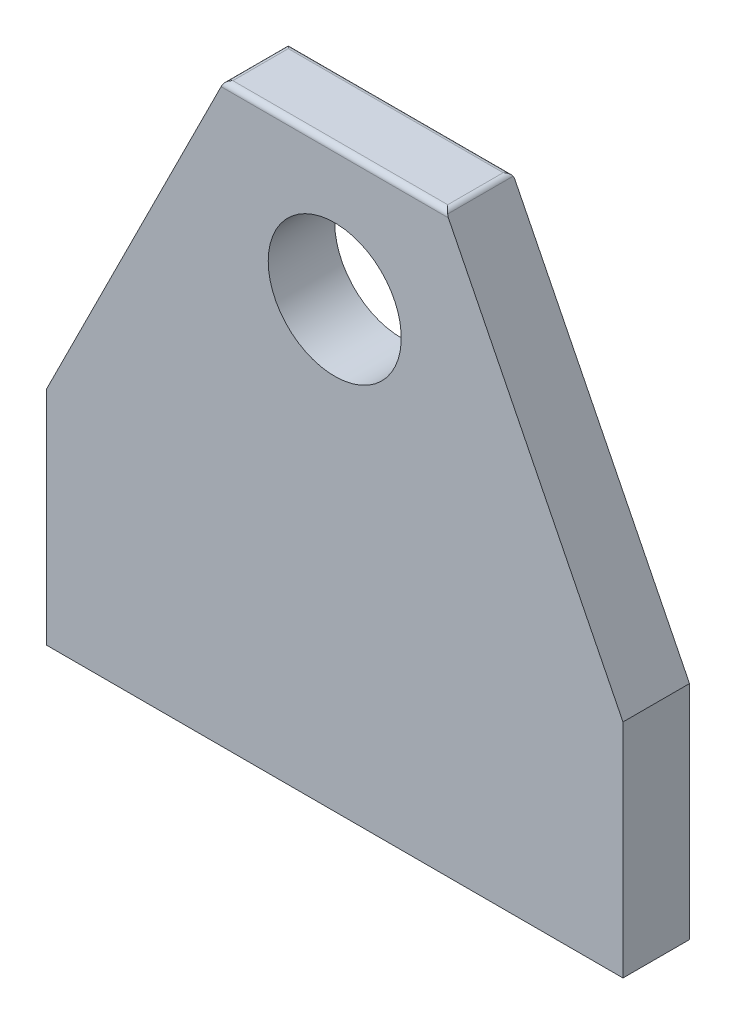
from build123d import *

# Parameters (mm, degrees)
SKETCH1_R          = 9.525
BASE_EXTRUDE_DEPTH = 9.525
FILLET1_R          = 0.79375


with BuildPart() as part:
    # Sketch1 → Base-Extrude (new body)
    with BuildSketch(Plane.XY):
        Polygon((-15.875, 82.55), (15.875, 82.55), (41.275, 31.75), (41.275, 0), (-41.275, 0), (-41.275, 31.75), align=None)
        with Locations(Location((0, 63.5, 0), (0, 0, 180))):
            Circle(SKETCH1_R, mode=Mode.SUBTRACT)
    extrude(amount=BASE_EXTRUDE_DEPTH)

    # Fillet1
    fillet1_edges = [part.edges().sort_by_distance(p)[0] for p in [
        (-15.875, 82.55, 4.7625),
        (0, 82.55, 9.525),
        (0, 82.55, 0),
        (15.875, 82.55, 4.7625),
    ]]
    fillet(fillet1_edges, radius=FILLET1_R)


solid = part.part
